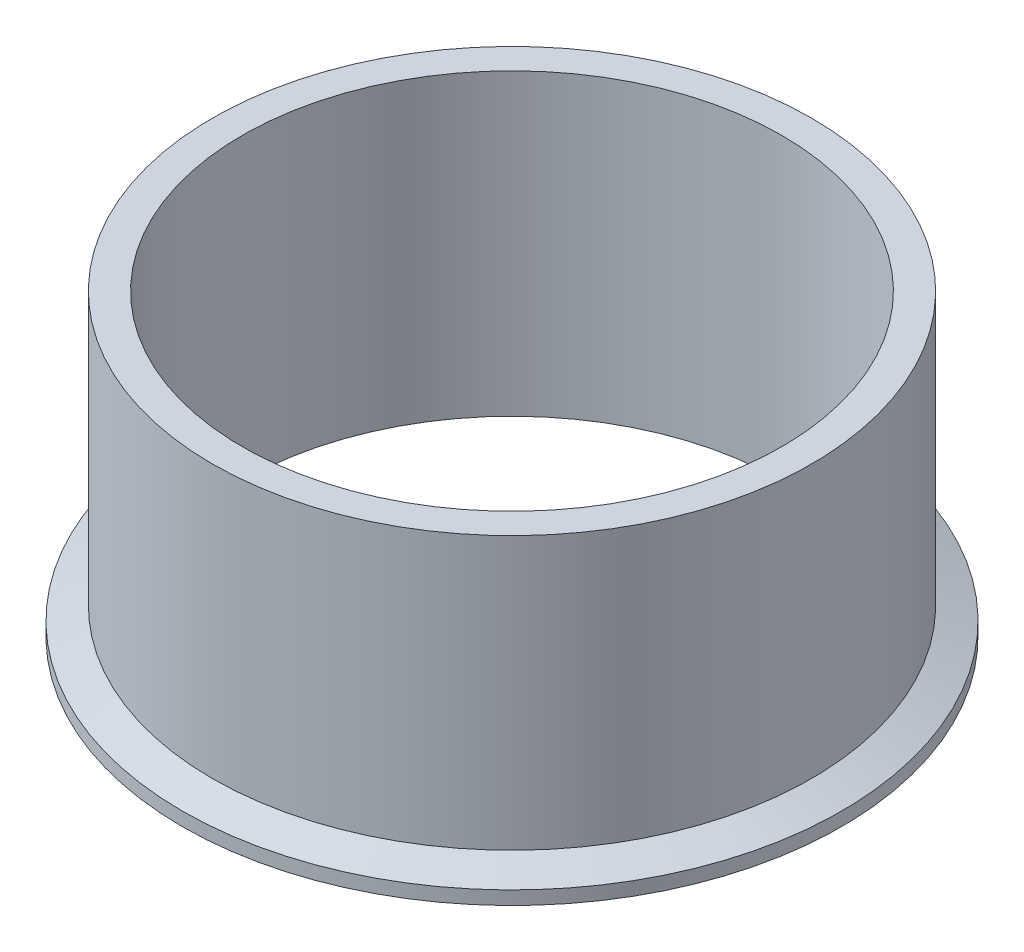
from build123d import *


with BuildPart() as part:
    # Sketch1 → Revolve2 (revolve)
    with BuildSketch(Plane.XY, mode=Mode.PRIVATE) as revolve2_sk:
        with BuildLine():
            Line((-48.6664, 0), (-48.6664, 53.975))
            Line((-48.6664, 53.975), (-54.0512, 53.975))
            Line((-54.0512, 53.975), (-54.0512, 4.813951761))
            Line((-54.0512, 4.813951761), (-59.4614, 2.4384))
            Line((-59.4614, 2.4384), (-59.4614, 0))
            Line((-59.4614, 0), (-56.774260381, 0))
            ThreePointArc((-56.774260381, 0), (-56.353684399, 0.126579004), (-56.072835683, 0.46426288))
            Line((-56.072835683, 0.46426288), (-55.899398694, 0.872854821))
            ThreePointArc((-55.899398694, 0.872854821), (-54.8005, 1.6002), (-53.701601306, 0.872854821))
            Line((-53.701601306, 0.872854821), (-53.528164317, 0.46426288))
            ThreePointArc((-53.528164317, 0.46426288), (-53.247315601, 0.126579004), (-52.826739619, 0))
            Line((-52.826739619, 0), (-48.6664, 0))
        make_face()
    revolve(revolve2_sk.sketch.rotate(Axis((0, 0, 0), (0, 1, 0)), 270), axis=Axis((0, 0, 0), (0, 1, 0)))


solid = part.part
